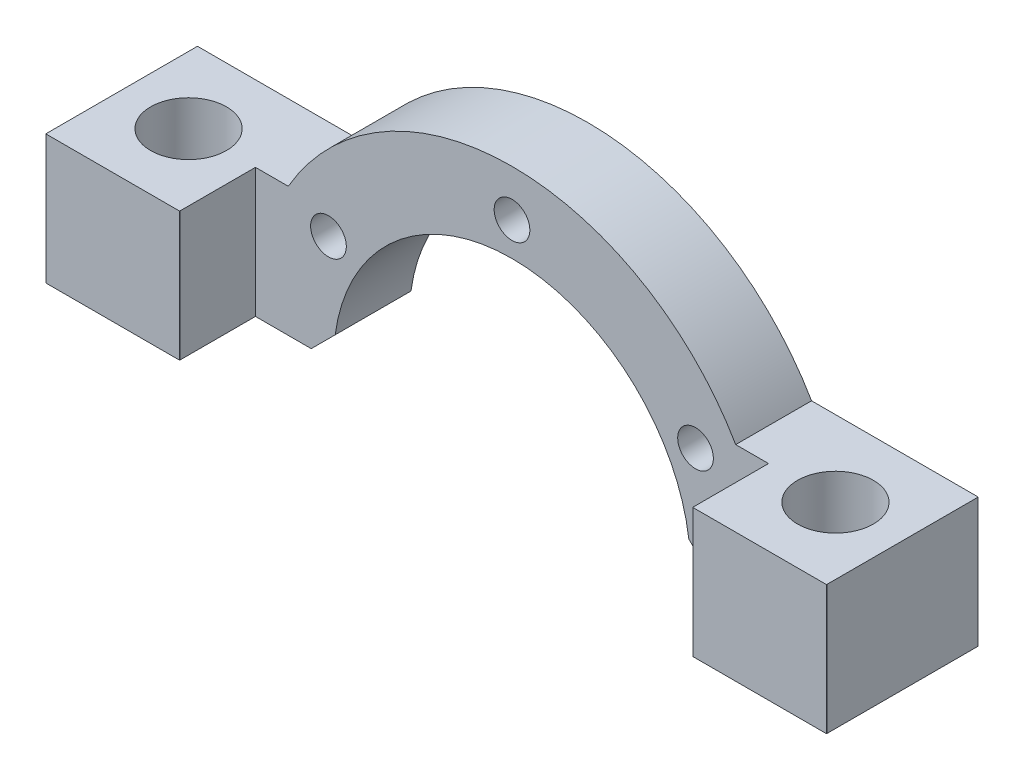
ISO-10303-21;
HEADER;
FILE_DESCRIPTION(('STEP AP214'),'2;1');
FILE_NAME('part.step','',(''),(''),'','','');
FILE_SCHEMA(('AUTOMOTIVE_DESIGN { 1 0 10303 214 1 1 1 1 }'));
ENDSEC;
DATA;
#1=APPLICATION_CONTEXT('core data for automotive mechanical design processes');
#2=APPLICATION_PROTOCOL_DEFINITION('international standard','automotive_design',2000,#1);
#3=PRODUCT_CONTEXT('',#1,'mechanical');
#4=PRODUCT('Part','Part','',(#3));
#5=PRODUCT_RELATED_PRODUCT_CATEGORY('part','',(#4));
#6=PRODUCT_DEFINITION_FORMATION('','',#4);
#7=PRODUCT_DEFINITION_CONTEXT('part definition',#1,'design');
#8=PRODUCT_DEFINITION('design','',#6,#7);
#9=PRODUCT_DEFINITION_SHAPE('','',#8);
#10=(LENGTH_UNIT() NAMED_UNIT(*) SI_UNIT(.MILLI.,.METRE.));
#11=(NAMED_UNIT(*) PLANE_ANGLE_UNIT() SI_UNIT($,.RADIAN.));
#12=(NAMED_UNIT(*) SI_UNIT($,.STERADIAN.) SOLID_ANGLE_UNIT());
#13=UNCERTAINTY_MEASURE_WITH_UNIT(LENGTH_MEASURE(1.E-05),#10,'distance_accuracy_value','');
#14=(GEOMETRIC_REPRESENTATION_CONTEXT(3) GLOBAL_UNCERTAINTY_ASSIGNED_CONTEXT((#13)) GLOBAL_UNIT_ASSIGNED_CONTEXT((#10,
#11,#12)) REPRESENTATION_CONTEXT('',''));
#15=CARTESIAN_POINT('',(0.,0.,0.));
#16=DIRECTION('',(0.,0.,1.));
#17=DIRECTION('',(1.,0.,0.));
#18=AXIS2_PLACEMENT_3D('',#15,#16,#17);
#19=CARTESIAN_POINT('',(0.,0.,3.4));
#20=DIRECTION('',(0.,0.,-1.));
#21=DIRECTION('',(-1.,0.,0.));
#22=AXIS2_PLACEMENT_3D('',#19,#20,#21);
#23=PLANE('',#22);
#24=CARTESIAN_POINT('',(8.22724133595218,4.74999999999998,3.4));
#25=DIRECTION('',(0.,0.,-1.));
#26=DIRECTION('',(-1.,0.,0.));
#27=AXIS2_PLACEMENT_3D('',#24,#25,#26);
#28=CIRCLE('',#27,0.799999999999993);
#29=CARTESIAN_POINT('',(7.42724133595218,4.74999999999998,3.4));
#30=VERTEX_POINT('',#29);
#31=EDGE_CURVE('E312',#30,#30,#28,.T.);
#32=ORIENTED_EDGE('',*,*,#31,.T.);
#33=EDGE_LOOP('',(#32));
#34=FACE_BOUND('',#33,.T.);
#35=CARTESIAN_POINT('',(0.,9.5,3.4));
#36=DIRECTION('',(0.,0.,-1.));
#37=DIRECTION('',(-1.,0.,0.));
#38=AXIS2_PLACEMENT_3D('',#35,#36,#37);
#39=CIRCLE('',#38,0.799999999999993);
#40=CARTESIAN_POINT('',(-0.799999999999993,9.5,3.4));
#41=VERTEX_POINT('',#40);
#42=EDGE_CURVE('E320',#41,#41,#39,.T.);
#43=ORIENTED_EDGE('',*,*,#42,.T.);
#44=EDGE_LOOP('',(#43));
#45=FACE_BOUND('',#44,.T.);
#46=CARTESIAN_POINT('',(-8.22724133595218,4.74999999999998,3.4));
#47=DIRECTION('',(0.,0.,-1.));
#48=DIRECTION('',(-1.,0.,0.));
#49=AXIS2_PLACEMENT_3D('',#46,#47,#48);
#50=CIRCLE('',#49,0.799999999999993);
#51=CARTESIAN_POINT('',(-9.02724133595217,4.74999999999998,3.4));
#52=VERTEX_POINT('',#51);
#53=EDGE_CURVE('E328',#52,#52,#50,.T.);
#54=ORIENTED_EDGE('',*,*,#53,.T.);
#55=EDGE_LOOP('',(#54));
#56=FACE_BOUND('',#55,.T.);
#57=CARTESIAN_POINT('',(0.,0.,3.4));
#58=DIRECTION('',(0.,0.,-1.));
#59=DIRECTION('',(-1.,0.,0.));
#60=AXIS2_PLACEMENT_3D('',#57,#58,#59);
#61=CIRCLE('',#60,8.);
#62=CARTESIAN_POINT('',(-7.92782730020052,1.07217269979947,3.4));
#63=VERTEX_POINT('',#62);
#64=CARTESIAN_POINT('',(7.92782730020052,1.07217269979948,3.4));
#65=VERTEX_POINT('',#64);
#66=EDGE_CURVE('E356',#63,#65,#61,.T.);
#67=ORIENTED_EDGE('',*,*,#66,.T.);
#68=DIRECTION('',(-0.707106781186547,0.707106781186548,0.));
#69=VECTOR('',#68,1.);
#70=CARTESIAN_POINT('',(9.,0.,3.4));
#71=LINE('',#70,#69);
#72=CARTESIAN_POINT('',(9.,0.,3.4));
#73=VERTEX_POINT('',#72);
#74=EDGE_CURVE('E98',#65,#73,#71,.F.);
#75=ORIENTED_EDGE('',*,*,#74,.T.);
#76=DIRECTION('',(1.,0.,0.));
#77=VECTOR('',#76,1.);
#78=CARTESIAN_POINT('',(17.5,0.,3.4));
#79=LINE('',#78,#77);
#80=CARTESIAN_POINT('',(11.5,0.,3.4));
#81=VERTEX_POINT('',#80);
#82=EDGE_CURVE('E359',#73,#81,#79,.T.);
#83=ORIENTED_EDGE('',*,*,#82,.T.);
#84=DIRECTION('',(0.,-1.,0.));
#85=VECTOR('',#84,1.);
#86=CARTESIAN_POINT('',(11.5,11.58,3.4));
#87=LINE('',#86,#85);
#88=CARTESIAN_POINT('',(11.5,5.79,3.4));
#89=VERTEX_POINT('',#88);
#90=EDGE_CURVE('E332',#89,#81,#87,.T.);
#91=ORIENTED_EDGE('',*,*,#90,.F.);
#92=DIRECTION('',(-1.,0.,0.));
#93=VECTOR('',#92,1.);
#94=CARTESIAN_POINT('',(0.,5.79,3.4));
#95=LINE('',#94,#93);
#96=CARTESIAN_POINT('',(10.0285741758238,5.79,3.4));
#97=VERTEX_POINT('',#96);
#98=EDGE_CURVE('E274',#89,#97,#95,.T.);
#99=ORIENTED_EDGE('',*,*,#98,.T.);
#100=CARTESIAN_POINT('',(0.,0.,3.4));
#101=DIRECTION('',(0.,0.,-1.));
#102=DIRECTION('',(-1.,0.,0.));
#103=AXIS2_PLACEMENT_3D('',#100,#101,#102);
#104=CIRCLE('',#103,11.58);
#105=CARTESIAN_POINT('',(-10.0285741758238,5.79,3.4));
#106=VERTEX_POINT('',#105);
#107=EDGE_CURVE('E250',#106,#97,#104,.T.);
#108=ORIENTED_EDGE('',*,*,#107,.F.);
#109=DIRECTION('',(-1.,0.,0.));
#110=VECTOR('',#109,1.);
#111=CARTESIAN_POINT('',(0.,5.79,3.4));
#112=LINE('',#111,#110);
#113=CARTESIAN_POINT('',(-11.5,5.79,3.4));
#114=VERTEX_POINT('',#113);
#115=EDGE_CURVE('E299',#106,#114,#112,.T.);
#116=ORIENTED_EDGE('',*,*,#115,.T.);
#117=DIRECTION('',(0.,1.,0.));
#118=VECTOR('',#117,1.);
#119=CARTESIAN_POINT('',(-11.5,11.58,3.4));
#120=LINE('',#119,#118);
#121=CARTESIAN_POINT('',(-11.5,0.,3.4));
#122=VERTEX_POINT('',#121);
#123=EDGE_CURVE('E344',#122,#114,#120,.T.);
#124=ORIENTED_EDGE('',*,*,#123,.F.);
#125=DIRECTION('',(1.,0.,0.));
#126=VECTOR('',#125,1.);
#127=CARTESIAN_POINT('',(-8.,0.,3.4));
#128=LINE('',#127,#126);
#129=CARTESIAN_POINT('',(-9.,0.,3.4));
#130=VERTEX_POINT('',#129);
#131=EDGE_CURVE('E363',#122,#130,#128,.T.);
#132=ORIENTED_EDGE('',*,*,#131,.T.);
#133=DIRECTION('',(-0.707106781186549,-0.707106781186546,0.));
#134=VECTOR('',#133,1.);
#135=CARTESIAN_POINT('',(-7.92782730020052,1.07217269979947,3.4));
#136=LINE('',#135,#134);
#137=EDGE_CURVE('E462',#130,#63,#136,.F.);
#138=ORIENTED_EDGE('',*,*,#137,.T.);
#139=EDGE_LOOP('',(#67,#75,#83,#91,#99,#108,#116,#124,#132,#138));
#140=FACE_BOUND('',#139,.T.);
#141=ADVANCED_FACE('F87',(#34,#45,#56,#140),#23,.F.);
#142=CARTESIAN_POINT('',(0.,0.,0.));
#143=DIRECTION('',(0.,0.,-1.));
#144=DIRECTION('',(-1.,0.,0.));
#145=AXIS2_PLACEMENT_3D('',#142,#143,#144);
#146=PLANE('',#145);
#147=CARTESIAN_POINT('',(8.22724133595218,4.74999999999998,0.));
#148=DIRECTION('',(0.,0.,-1.));
#149=DIRECTION('',(-1.,0.,0.));
#150=AXIS2_PLACEMENT_3D('',#147,#148,#149);
#151=CIRCLE('',#150,0.799999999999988);
#152=CARTESIAN_POINT('',(7.42724133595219,4.74999999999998,0.));
#153=VERTEX_POINT('',#152);
#154=EDGE_CURVE('E308',#153,#153,#151,.T.);
#155=ORIENTED_EDGE('',*,*,#154,.F.);
#156=EDGE_LOOP('',(#155));
#157=FACE_BOUND('',#156,.T.);
#158=CARTESIAN_POINT('',(0.,9.5,0.));
#159=DIRECTION('',(0.,0.,-1.));
#160=DIRECTION('',(-1.,0.,0.));
#161=AXIS2_PLACEMENT_3D('',#158,#159,#160);
#162=CIRCLE('',#161,0.799999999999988);
#163=CARTESIAN_POINT('',(-0.799999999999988,9.5,0.));
#164=VERTEX_POINT('',#163);
#165=EDGE_CURVE('E316',#164,#164,#162,.T.);
#166=ORIENTED_EDGE('',*,*,#165,.F.);
#167=EDGE_LOOP('',(#166));
#168=FACE_BOUND('',#167,.T.);
#169=CARTESIAN_POINT('',(-8.22724133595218,4.74999999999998,0.));
#170=DIRECTION('',(0.,0.,-1.));
#171=DIRECTION('',(-1.,0.,0.));
#172=AXIS2_PLACEMENT_3D('',#169,#170,#171);
#173=CIRCLE('',#172,0.799999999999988);
#174=CARTESIAN_POINT('',(-9.02724133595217,4.74999999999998,0.));
#175=VERTEX_POINT('',#174);
#176=EDGE_CURVE('E324',#175,#175,#173,.T.);
#177=ORIENTED_EDGE('',*,*,#176,.F.);
#178=EDGE_LOOP('',(#177));
#179=FACE_BOUND('',#178,.T.);
#180=DIRECTION('',(1.,0.,0.));
#181=VECTOR('',#180,1.);
#182=CARTESIAN_POINT('',(17.5,0.,0.));
#183=LINE('',#182,#181);
#184=CARTESIAN_POINT('',(9.,0.,0.));
#185=VERTEX_POINT('',#184);
#186=CARTESIAN_POINT('',(17.49,0.,0.));
#187=VERTEX_POINT('',#186);
#188=EDGE_CURVE('E369',#185,#187,#183,.T.);
#189=ORIENTED_EDGE('',*,*,#188,.F.);
#190=DIRECTION('',(0.707106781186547,-0.707106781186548,0.));
#191=VECTOR('',#190,1.);
#192=CARTESIAN_POINT('',(4.5,4.5,0.));
#193=LINE('',#192,#191);
#194=CARTESIAN_POINT('',(7.92782730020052,1.07217269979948,0.));
#195=VERTEX_POINT('',#194);
#196=EDGE_CURVE('E453',#185,#195,#193,.F.);
#197=ORIENTED_EDGE('',*,*,#196,.T.);
#198=CARTESIAN_POINT('',(0.,0.,0.));
#199=DIRECTION('',(0.,0.,-1.));
#200=DIRECTION('',(-1.,0.,0.));
#201=AXIS2_PLACEMENT_3D('',#198,#199,#200);
#202=CIRCLE('',#201,8.);
#203=CARTESIAN_POINT('',(-7.92782730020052,1.07217269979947,0.));
#204=VERTEX_POINT('',#203);
#205=EDGE_CURVE('E355',#204,#195,#202,.T.);
#206=ORIENTED_EDGE('',*,*,#205,.F.);
#207=DIRECTION('',(0.707106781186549,0.707106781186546,0.));
#208=VECTOR('',#207,1.);
#209=CARTESIAN_POINT('',(-4.49999999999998,4.5,0.));
#210=LINE('',#209,#208);
#211=CARTESIAN_POINT('',(-9.,0.,0.));
#212=VERTEX_POINT('',#211);
#213=EDGE_CURVE('E450',#204,#212,#210,.F.);
#214=ORIENTED_EDGE('',*,*,#213,.T.);
#215=DIRECTION('',(1.,0.,0.));
#216=VECTOR('',#215,1.);
#217=CARTESIAN_POINT('',(-8.,0.,0.));
#218=LINE('',#217,#216);
#219=CARTESIAN_POINT('',(-17.49,0.,0.));
#220=VERTEX_POINT('',#219);
#221=EDGE_CURVE('E360',#220,#212,#218,.T.);
#222=ORIENTED_EDGE('',*,*,#221,.F.);
#223=DIRECTION('',(0.,1.,0.));
#224=VECTOR('',#223,1.);
#225=CARTESIAN_POINT('',(-17.49,11.58,0.));
#226=LINE('',#225,#224);
#227=CARTESIAN_POINT('',(-17.49,5.79,0.));
#228=VERTEX_POINT('',#227);
#229=EDGE_CURVE('E388',#220,#228,#226,.T.);
#230=ORIENTED_EDGE('',*,*,#229,.T.);
#231=DIRECTION('',(1.,0.,0.));
#232=VECTOR('',#231,1.);
#233=CARTESIAN_POINT('',(0.,5.79,0.));
#234=LINE('',#233,#232);
#235=CARTESIAN_POINT('',(-10.0285741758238,5.79,0.));
#236=VERTEX_POINT('',#235);
#237=EDGE_CURVE('E239',#228,#236,#234,.T.);
#238=ORIENTED_EDGE('',*,*,#237,.T.);
#239=CARTESIAN_POINT('',(0.,0.,0.));
#240=DIRECTION('',(0.,0.,1.));
#241=DIRECTION('',(1.,0.,0.));
#242=AXIS2_PLACEMENT_3D('',#239,#240,#241);
#243=CIRCLE('',#242,11.58);
#244=CARTESIAN_POINT('',(10.0285741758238,5.79,0.));
#245=VERTEX_POINT('',#244);
#246=EDGE_CURVE('E230',#245,#236,#243,.T.);
#247=ORIENTED_EDGE('',*,*,#246,.F.);
#248=DIRECTION('',(1.,0.,0.));
#249=VECTOR('',#248,1.);
#250=CARTESIAN_POINT('',(0.,5.79,0.));
#251=LINE('',#250,#249);
#252=CARTESIAN_POINT('',(17.49,5.79,0.));
#253=VERTEX_POINT('',#252);
#254=EDGE_CURVE('E236',#245,#253,#251,.T.);
#255=ORIENTED_EDGE('',*,*,#254,.T.);
#256=DIRECTION('',(0.,-1.,0.));
#257=VECTOR('',#256,1.);
#258=CARTESIAN_POINT('',(17.49,0.,0.));
#259=LINE('',#258,#257);
#260=EDGE_CURVE('E391',#253,#187,#259,.T.);
#261=ORIENTED_EDGE('',*,*,#260,.T.);
#262=EDGE_LOOP('',(#189,#197,#206,#214,#222,#230,#238,#247,#255,#261));
#263=FACE_BOUND('',#262,.T.);
#264=ADVANCED_FACE('F233',(#157,#168,#179,#263),#146,.T.);
#265=CARTESIAN_POINT('',(0.,0.,3.4));
#266=DIRECTION('',(0.,0.,-1.));
#267=DIRECTION('',(-1.,0.,0.));
#268=AXIS2_PLACEMENT_3D('',#265,#266,#267);
#269=CYLINDRICAL_SURFACE('',#268,8.);
#270=ORIENTED_EDGE('',*,*,#205,.T.);
#271=DIRECTION('',(0.,0.,-1.));
#272=VECTOR('',#271,1.);
#273=CARTESIAN_POINT('',(7.92782730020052,1.07217269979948,3.4));
#274=LINE('',#273,#272);
#275=EDGE_CURVE('E112',#195,#65,#274,.F.);
#276=ORIENTED_EDGE('',*,*,#275,.T.);
#277=ORIENTED_EDGE('',*,*,#66,.F.);
#278=DIRECTION('',(0.,0.,-1.));
#279=VECTOR('',#278,1.);
#280=CARTESIAN_POINT('',(-7.92782730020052,1.07217269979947,3.4));
#281=LINE('',#280,#279);
#282=EDGE_CURVE('E456',#63,#204,#281,.T.);
#283=ORIENTED_EDGE('',*,*,#282,.T.);
#284=EDGE_LOOP('',(#270,#276,#277,#283));
#285=FACE_BOUND('',#284,.T.);
#286=ADVANCED_FACE('F510',(#285),#269,.F.);
#287=CARTESIAN_POINT('',(17.5,0.,3.4));
#288=DIRECTION('',(0.,1.,0.));
#289=DIRECTION('',(-1.,0.,0.));
#290=AXIS2_PLACEMENT_3D('',#287,#288,#289);
#291=PLANE('',#290);
#292=CARTESIAN_POINT('',(14.5,0.,3.4));
#293=DIRECTION('',(0.,1.,0.));
#294=DIRECTION('',(0.,0.,-1.));
#295=AXIS2_PLACEMENT_3D('',#292,#293,#294);
#296=CIRCLE('',#295,1.7);
#297=CARTESIAN_POINT('',(14.5,0.,1.7));
#298=VERTEX_POINT('',#297);
#299=EDGE_CURVE('E477',#298,#298,#296,.T.);
#300=ORIENTED_EDGE('',*,*,#299,.T.);
#301=EDGE_LOOP('',(#300));
#302=FACE_BOUND('',#301,.T.);
#303=ORIENTED_EDGE('',*,*,#82,.F.);
#304=DIRECTION('',(0.,0.,-1.));
#305=VECTOR('',#304,1.);
#306=CARTESIAN_POINT('',(9.,0.,3.4));
#307=LINE('',#306,#305);
#308=EDGE_CURVE('E446',#73,#185,#307,.T.);
#309=ORIENTED_EDGE('',*,*,#308,.T.);
#310=ORIENTED_EDGE('',*,*,#188,.T.);
#311=DIRECTION('',(0.707106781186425,0.,0.70710678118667));
#312=VECTOR('',#311,1.);
#313=CARTESIAN_POINT('',(17.5,0.,0.00999999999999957));
#314=LINE('',#313,#312);
#315=CARTESIAN_POINT('',(17.5,0.,0.00999999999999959));
#316=VERTEX_POINT('',#315);
#317=EDGE_CURVE('E400',#187,#316,#314,.T.);
#318=ORIENTED_EDGE('',*,*,#317,.T.);
#319=DIRECTION('',(0.,0.,-1.));
#320=VECTOR('',#319,1.);
#321=CARTESIAN_POINT('',(17.5,0.,3.4));
#322=LINE('',#321,#320);
#323=CARTESIAN_POINT('',(17.5,0.,6.79));
#324=VERTEX_POINT('',#323);
#325=EDGE_CURVE('E377',#324,#316,#322,.T.);
#326=ORIENTED_EDGE('',*,*,#325,.F.);
#327=DIRECTION('',(0.707106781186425,0.,-0.70710678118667));
#328=VECTOR('',#327,1.);
#329=CARTESIAN_POINT('',(17.49,0.,6.8));
#330=LINE('',#329,#328);
#331=CARTESIAN_POINT('',(17.49,0.,6.8));
#332=VERTEX_POINT('',#331);
#333=EDGE_CURVE('E397',#324,#332,#330,.F.);
#334=ORIENTED_EDGE('',*,*,#333,.T.);
#335=DIRECTION('',(1.,0.,0.));
#336=VECTOR('',#335,1.);
#337=CARTESIAN_POINT('',(17.5,0.,6.8));
#338=LINE('',#337,#336);
#339=CARTESIAN_POINT('',(11.51,0.,6.8));
#340=VERTEX_POINT('',#339);
#341=EDGE_CURVE('E333',#340,#332,#338,.T.);
#342=ORIENTED_EDGE('',*,*,#341,.F.);
#343=DIRECTION('',(0.707106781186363,0.,0.707106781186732));
#344=VECTOR('',#343,1.);
#345=CARTESIAN_POINT('',(11.51,0.,6.8));
#346=LINE('',#345,#344);
#347=CARTESIAN_POINT('',(11.5,0.,6.79));
#348=VERTEX_POINT('',#347);
#349=EDGE_CURVE('E394',#340,#348,#346,.F.);
#350=ORIENTED_EDGE('',*,*,#349,.T.);
#351=DIRECTION('',(0.,0.,-1.));
#352=VECTOR('',#351,1.);
#353=CARTESIAN_POINT('',(11.5,0.,6.8));
#354=LINE('',#353,#352);
#355=EDGE_CURVE('E337',#348,#81,#354,.T.);
#356=ORIENTED_EDGE('',*,*,#355,.T.);
#357=EDGE_LOOP('',(#303,#309,#310,#318,#326,#334,#342,#350,#356));
#358=FACE_BOUND('',#357,.T.);
#359=ADVANCED_FACE('F487',(#302,#358),#291,.F.);
#360=CARTESIAN_POINT('',(17.5,11.58,3.4));
#361=DIRECTION('',(-1.,0.,0.));
#362=DIRECTION('',(0.,0.,1.));
#363=AXIS2_PLACEMENT_3D('',#360,#361,#362);
#364=PLANE('',#363);
#365=DIRECTION('',(0.,1.,0.));
#366=VECTOR('',#365,1.);
#367=CARTESIAN_POINT('',(17.5,11.58,0.00999999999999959));
#368=LINE('',#367,#366);
#369=CARTESIAN_POINT('',(17.5,5.79,0.00999999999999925));
#370=VERTEX_POINT('',#369);
#371=EDGE_CURVE('E384',#316,#370,#368,.T.);
#372=ORIENTED_EDGE('',*,*,#371,.T.);
#373=DIRECTION('',(0.,0.,1.));
#374=VECTOR('',#373,1.);
#375=CARTESIAN_POINT('',(17.5,5.79,0.));
#376=LINE('',#375,#374);
#377=CARTESIAN_POINT('',(17.5,5.79,6.79));
#378=VERTEX_POINT('',#377);
#379=EDGE_CURVE('E254',#370,#378,#376,.T.);
#380=ORIENTED_EDGE('',*,*,#379,.T.);
#381=DIRECTION('',(0.,-1.,0.));
#382=VECTOR('',#381,1.);
#383=CARTESIAN_POINT('',(17.5,11.58,6.79));
#384=LINE('',#383,#382);
#385=EDGE_CURVE('E381',#378,#324,#384,.T.);
#386=ORIENTED_EDGE('',*,*,#385,.T.);
#387=ORIENTED_EDGE('',*,*,#325,.T.);
#388=EDGE_LOOP('',(#372,#380,#386,#387));
#389=FACE_BOUND('',#388,.T.);
#390=ADVANCED_FACE('F524',(#389),#364,.F.);
#391=CARTESIAN_POINT('',(-17.5,0.,3.4));
#392=DIRECTION('',(1.,0.,0.));
#393=DIRECTION('',(0.,0.,-1.));
#394=AXIS2_PLACEMENT_3D('',#391,#392,#393);
#395=PLANE('',#394);
#396=DIRECTION('',(0.,1.,0.));
#397=VECTOR('',#396,1.);
#398=CARTESIAN_POINT('',(-17.5,11.58,6.79));
#399=LINE('',#398,#397);
#400=CARTESIAN_POINT('',(-17.5,0.,6.79));
#401=VERTEX_POINT('',#400);
#402=CARTESIAN_POINT('',(-17.5,5.79,6.79));
#403=VERTEX_POINT('',#402);
#404=EDGE_CURVE('E414',#401,#403,#399,.T.);
#405=ORIENTED_EDGE('',*,*,#404,.T.);
#406=DIRECTION('',(0.,0.,1.));
#407=VECTOR('',#406,1.);
#408=CARTESIAN_POINT('',(-17.5,5.79,0.));
#409=LINE('',#408,#407);
#410=CARTESIAN_POINT('',(-17.5,5.79,0.00999999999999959));
#411=VERTEX_POINT('',#410);
#412=EDGE_CURVE('E286',#411,#403,#409,.T.);
#413=ORIENTED_EDGE('',*,*,#412,.F.);
#414=DIRECTION('',(0.,-1.,0.));
#415=VECTOR('',#414,1.);
#416=CARTESIAN_POINT('',(-17.5,0.,0.00999999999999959));
#417=LINE('',#416,#415);
#418=CARTESIAN_POINT('',(-17.5,0.,0.00999999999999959));
#419=VERTEX_POINT('',#418);
#420=EDGE_CURVE('E418',#411,#419,#417,.T.);
#421=ORIENTED_EDGE('',*,*,#420,.T.);
#422=DIRECTION('',(0.,0.,-1.));
#423=VECTOR('',#422,1.);
#424=CARTESIAN_POINT('',(-17.5,0.,3.4));
#425=LINE('',#424,#423);
#426=EDGE_CURVE('E366',#401,#419,#425,.T.);
#427=ORIENTED_EDGE('',*,*,#426,.F.);
#428=EDGE_LOOP('',(#405,#413,#421,#427));
#429=FACE_BOUND('',#428,.T.);
#430=ADVANCED_FACE('F521',(#429),#395,.F.);
#431=CARTESIAN_POINT('',(-8.,0.,3.4));
#432=DIRECTION('',(0.,1.,0.));
#433=DIRECTION('',(-1.,0.,0.));
#434=AXIS2_PLACEMENT_3D('',#431,#432,#433);
#435=PLANE('',#434);
#436=CARTESIAN_POINT('',(-14.5,0.,3.4));
#437=DIRECTION('',(0.,1.,0.));
#438=DIRECTION('',(0.,0.,1.));
#439=AXIS2_PLACEMENT_3D('',#436,#437,#438);
#440=CIRCLE('',#439,1.7);
#441=CARTESIAN_POINT('',(-14.5,0.,5.1));
#442=VERTEX_POINT('',#441);
#443=EDGE_CURVE('E469',#442,#442,#440,.T.);
#444=ORIENTED_EDGE('',*,*,#443,.T.);
#445=EDGE_LOOP('',(#444));
#446=FACE_BOUND('',#445,.T.);
#447=ORIENTED_EDGE('',*,*,#221,.T.);
#448=DIRECTION('',(0.,0.,1.));
#449=VECTOR('',#448,1.);
#450=CARTESIAN_POINT('',(-9.,0.,3.4));
#451=LINE('',#450,#449);
#452=EDGE_CURVE('E12',#212,#130,#451,.T.);
#453=ORIENTED_EDGE('',*,*,#452,.T.);
#454=ORIENTED_EDGE('',*,*,#131,.F.);
#455=DIRECTION('',(0.,0.,-1.));
#456=VECTOR('',#455,1.);
#457=CARTESIAN_POINT('',(-11.5,0.,6.8));
#458=LINE('',#457,#456);
#459=CARTESIAN_POINT('',(-11.5,0.,6.79));
#460=VERTEX_POINT('',#459);
#461=EDGE_CURVE('E349',#460,#122,#458,.T.);
#462=ORIENTED_EDGE('',*,*,#461,.F.);
#463=DIRECTION('',(-0.707106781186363,0.,0.707106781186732));
#464=VECTOR('',#463,1.);
#465=CARTESIAN_POINT('',(-11.51,0.,6.8));
#466=LINE('',#465,#464);
#467=CARTESIAN_POINT('',(-11.51,0.,6.8));
#468=VERTEX_POINT('',#467);
#469=EDGE_CURVE('E424',#460,#468,#466,.T.);
#470=ORIENTED_EDGE('',*,*,#469,.T.);
#471=DIRECTION('',(1.,0.,0.));
#472=VECTOR('',#471,1.);
#473=CARTESIAN_POINT('',(-17.5,0.,6.8));
#474=LINE('',#473,#472);
#475=CARTESIAN_POINT('',(-17.49,0.,6.8));
#476=VERTEX_POINT('',#475);
#477=EDGE_CURVE('E345',#476,#468,#474,.T.);
#478=ORIENTED_EDGE('',*,*,#477,.F.);
#479=DIRECTION('',(-0.707106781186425,0.,-0.70710678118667));
#480=VECTOR('',#479,1.);
#481=CARTESIAN_POINT('',(-17.49,0.,6.8));
#482=LINE('',#481,#480);
#483=EDGE_CURVE('E421',#476,#401,#482,.T.);
#484=ORIENTED_EDGE('',*,*,#483,.T.);
#485=ORIENTED_EDGE('',*,*,#426,.T.);
#486=DIRECTION('',(0.707106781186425,0.,-0.70710678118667));
#487=VECTOR('',#486,1.);
#488=CARTESIAN_POINT('',(-17.5,0.,0.00999999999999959));
#489=LINE('',#488,#487);
#490=EDGE_CURVE('E427',#419,#220,#489,.T.);
#491=ORIENTED_EDGE('',*,*,#490,.T.);
#492=EDGE_LOOP('',(#447,#453,#454,#462,#470,#478,#484,#485,#491));
#493=FACE_BOUND('',#492,.T.);
#494=ADVANCED_FACE('F518',(#446,#493),#435,.F.);
#495=CARTESIAN_POINT('',(-11.5,11.58,6.8));
#496=DIRECTION('',(-1.,0.,0.));
#497=DIRECTION('',(0.,-1.,0.));
#498=AXIS2_PLACEMENT_3D('',#495,#496,#497);
#499=PLANE('',#498);
#500=ORIENTED_EDGE('',*,*,#123,.T.);
#501=DIRECTION('',(0.,0.,1.));
#502=VECTOR('',#501,1.);
#503=CARTESIAN_POINT('',(-11.5,5.79,6.8));
#504=LINE('',#503,#502);
#505=CARTESIAN_POINT('',(-11.5,5.79,6.79));
#506=VERTEX_POINT('',#505);
#507=EDGE_CURVE('E295',#114,#506,#504,.T.);
#508=ORIENTED_EDGE('',*,*,#507,.T.);
#509=DIRECTION('',(0.,-1.,0.));
#510=VECTOR('',#509,1.);
#511=CARTESIAN_POINT('',(-11.5,0.,6.79));
#512=LINE('',#511,#510);
#513=EDGE_CURVE('E437',#506,#460,#512,.T.);
#514=ORIENTED_EDGE('',*,*,#513,.T.);
#515=ORIENTED_EDGE('',*,*,#461,.T.);
#516=EDGE_LOOP('',(#500,#508,#514,#515));
#517=FACE_BOUND('',#516,.T.);
#518=ADVANCED_FACE('F515',(#517),#499,.F.);
#519=CARTESIAN_POINT('',(0.,0.,6.8));
#520=DIRECTION('',(0.,0.,1.));
#521=DIRECTION('',(1.,0.,0.));
#522=AXIS2_PLACEMENT_3D('',#519,#520,#521);
#523=PLANE('',#522);
#524=DIRECTION('',(1.,0.,0.));
#525=VECTOR('',#524,1.);
#526=CARTESIAN_POINT('',(0.,5.79,6.8));
#527=LINE('',#526,#525);
#528=CARTESIAN_POINT('',(-17.49,5.79,6.8));
#529=VERTEX_POINT('',#528);
#530=CARTESIAN_POINT('',(-11.51,5.79,6.8));
#531=VERTEX_POINT('',#530);
#532=EDGE_CURVE('E244',#529,#531,#527,.T.);
#533=ORIENTED_EDGE('',*,*,#532,.F.);
#534=DIRECTION('',(0.,-1.,0.));
#535=VECTOR('',#534,1.);
#536=CARTESIAN_POINT('',(-17.49,0.,6.8));
#537=LINE('',#536,#535);
#538=EDGE_CURVE('E430',#529,#476,#537,.T.);
#539=ORIENTED_EDGE('',*,*,#538,.T.);
#540=ORIENTED_EDGE('',*,*,#477,.T.);
#541=DIRECTION('',(0.,1.,0.));
#542=VECTOR('',#541,1.);
#543=CARTESIAN_POINT('',(-11.51,11.58,6.8));
#544=LINE('',#543,#542);
#545=EDGE_CURVE('E433',#468,#531,#544,.T.);
#546=ORIENTED_EDGE('',*,*,#545,.T.);
#547=EDGE_LOOP('',(#533,#539,#540,#546));
#548=FACE_BOUND('',#547,.T.);
#549=ADVANCED_FACE('F626',(#548),#523,.T.);
#550=CARTESIAN_POINT('',(11.5,11.58,6.8));
#551=DIRECTION('',(1.,0.,0.));
#552=DIRECTION('',(0.,1.,0.));
#553=AXIS2_PLACEMENT_3D('',#550,#551,#552);
#554=PLANE('',#553);
#555=DIRECTION('',(0.,1.,0.));
#556=VECTOR('',#555,1.);
#557=CARTESIAN_POINT('',(11.5,11.58,6.79));
#558=LINE('',#557,#556);
#559=CARTESIAN_POINT('',(11.5,5.79,6.79));
#560=VERTEX_POINT('',#559);
#561=EDGE_CURVE('E410',#348,#560,#558,.T.);
#562=ORIENTED_EDGE('',*,*,#561,.T.);
#563=DIRECTION('',(0.,0.,-1.));
#564=VECTOR('',#563,1.);
#565=CARTESIAN_POINT('',(11.5,5.79,6.8));
#566=LINE('',#565,#564);
#567=EDGE_CURVE('E269',#560,#89,#566,.T.);
#568=ORIENTED_EDGE('',*,*,#567,.T.);
#569=ORIENTED_EDGE('',*,*,#90,.T.);
#570=ORIENTED_EDGE('',*,*,#355,.F.);
#571=EDGE_LOOP('',(#562,#568,#569,#570));
#572=FACE_BOUND('',#571,.T.);
#573=ADVANCED_FACE('F595',(#572),#554,.F.);
#574=CARTESIAN_POINT('',(0.,0.,6.8));
#575=DIRECTION('',(0.,0.,-1.));
#576=DIRECTION('',(-1.,0.,0.));
#577=AXIS2_PLACEMENT_3D('',#574,#575,#576);
#578=PLANE('',#577);
#579=DIRECTION('',(0.,1.,0.));
#580=VECTOR('',#579,1.);
#581=CARTESIAN_POINT('',(17.49,0.,6.8));
#582=LINE('',#581,#580);
#583=CARTESIAN_POINT('',(17.49,5.79,6.8));
#584=VERTEX_POINT('',#583);
#585=EDGE_CURVE('E406',#332,#584,#582,.T.);
#586=ORIENTED_EDGE('',*,*,#585,.T.);
#587=DIRECTION('',(1.,0.,0.));
#588=VECTOR('',#587,1.);
#589=CARTESIAN_POINT('',(0.,5.79,6.8));
#590=LINE('',#589,#588);
#591=CARTESIAN_POINT('',(11.51,5.79,6.8));
#592=VERTEX_POINT('',#591);
#593=EDGE_CURVE('E260',#592,#584,#590,.T.);
#594=ORIENTED_EDGE('',*,*,#593,.F.);
#595=DIRECTION('',(0.,-1.,0.));
#596=VECTOR('',#595,1.);
#597=CARTESIAN_POINT('',(11.51,0.,6.8));
#598=LINE('',#597,#596);
#599=EDGE_CURVE('E403',#592,#340,#598,.T.);
#600=ORIENTED_EDGE('',*,*,#599,.T.);
#601=ORIENTED_EDGE('',*,*,#341,.T.);
#602=EDGE_LOOP('',(#586,#594,#600,#601));
#603=FACE_BOUND('',#602,.T.);
#604=ADVANCED_FACE('F541',(#603),#578,.F.);
#605=CARTESIAN_POINT('',(17.5,11.58,0.00999999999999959));
#606=DIRECTION('',(0.70710678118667,0.,-0.707106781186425));
#607=DIRECTION('',(0.,-1.,0.));
#608=AXIS2_PLACEMENT_3D('',#605,#606,#607);
#609=PLANE('',#608);
#610=DIRECTION('',(-0.707106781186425,0.,-0.70710678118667));
#611=VECTOR('',#610,1.);
#612=CARTESIAN_POINT('',(17.5,5.79,0.00999999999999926));
#613=LINE('',#612,#611);
#614=EDGE_CURVE('E258',#370,#253,#613,.T.);
#615=ORIENTED_EDGE('',*,*,#614,.F.);
#616=ORIENTED_EDGE('',*,*,#371,.F.);
#617=ORIENTED_EDGE('',*,*,#317,.F.);
#618=ORIENTED_EDGE('',*,*,#260,.F.);
#619=EDGE_LOOP('',(#615,#616,#617,#618));
#620=FACE_BOUND('',#619,.T.);
#621=ADVANCED_FACE('F534',(#620),#609,.T.);
#622=CARTESIAN_POINT('',(17.49,0.,6.8));
#623=DIRECTION('',(-0.70710678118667,0.,-0.707106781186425));
#624=DIRECTION('',(0.,1.,0.));
#625=AXIS2_PLACEMENT_3D('',#622,#623,#624);
#626=PLANE('',#625);
#627=DIRECTION('',(-0.707106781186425,0.,0.70710678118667));
#628=VECTOR('',#627,1.);
#629=CARTESIAN_POINT('',(17.49,5.79,6.8));
#630=LINE('',#629,#628);
#631=EDGE_CURVE('E277',#584,#378,#630,.F.);
#632=ORIENTED_EDGE('',*,*,#631,.F.);
#633=ORIENTED_EDGE('',*,*,#585,.F.);
#634=ORIENTED_EDGE('',*,*,#333,.F.);
#635=ORIENTED_EDGE('',*,*,#385,.F.);
#636=EDGE_LOOP('',(#632,#633,#634,#635));
#637=FACE_BOUND('',#636,.T.);
#638=ADVANCED_FACE('F540',(#637),#626,.F.);
#639=CARTESIAN_POINT('',(11.51,0.,6.8));
#640=DIRECTION('',(0.707106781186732,0.,-0.707106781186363));
#641=DIRECTION('',(0.,-1.,0.));
#642=AXIS2_PLACEMENT_3D('',#639,#640,#641);
#643=PLANE('',#642);
#644=DIRECTION('',(-0.707106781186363,0.,-0.707106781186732));
#645=VECTOR('',#644,1.);
#646=CARTESIAN_POINT('',(11.51,5.79,6.8));
#647=LINE('',#646,#645);
#648=EDGE_CURVE('E443',#560,#592,#647,.F.);
#649=ORIENTED_EDGE('',*,*,#648,.F.);
#650=ORIENTED_EDGE('',*,*,#561,.F.);
#651=ORIENTED_EDGE('',*,*,#349,.F.);
#652=ORIENTED_EDGE('',*,*,#599,.F.);
#653=EDGE_LOOP('',(#649,#650,#651,#652));
#654=FACE_BOUND('',#653,.T.);
#655=ADVANCED_FACE('F548',(#654),#643,.F.);
#656=CARTESIAN_POINT('',(-17.5,0.,0.00999999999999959));
#657=DIRECTION('',(-0.70710678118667,0.,-0.707106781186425));
#658=DIRECTION('',(0.,1.,0.));
#659=AXIS2_PLACEMENT_3D('',#656,#657,#658);
#660=PLANE('',#659);
#661=DIRECTION('',(-0.707106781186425,0.,0.70710678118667));
#662=VECTOR('',#661,1.);
#663=CARTESIAN_POINT('',(-17.5,5.79,0.00999999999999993));
#664=LINE('',#663,#662);
#665=EDGE_CURVE('E303',#228,#411,#664,.T.);
#666=ORIENTED_EDGE('',*,*,#665,.F.);
#667=ORIENTED_EDGE('',*,*,#229,.F.);
#668=ORIENTED_EDGE('',*,*,#490,.F.);
#669=ORIENTED_EDGE('',*,*,#420,.F.);
#670=EDGE_LOOP('',(#666,#667,#668,#669));
#671=FACE_BOUND('',#670,.T.);
#672=ADVANCED_FACE('F555',(#671),#660,.T.);
#673=CARTESIAN_POINT('',(-11.51,0.,6.8));
#674=DIRECTION('',(0.707106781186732,0.,0.707106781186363));
#675=DIRECTION('',(0.,-1.,0.));
#676=AXIS2_PLACEMENT_3D('',#673,#674,#675);
#677=PLANE('',#676);
#678=DIRECTION('',(0.707106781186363,0.,-0.707106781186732));
#679=VECTOR('',#678,1.);
#680=CARTESIAN_POINT('',(-11.51,5.79,6.8));
#681=LINE('',#680,#679);
#682=EDGE_CURVE('E290',#531,#506,#681,.T.);
#683=ORIENTED_EDGE('',*,*,#682,.F.);
#684=ORIENTED_EDGE('',*,*,#545,.F.);
#685=ORIENTED_EDGE('',*,*,#469,.F.);
#686=ORIENTED_EDGE('',*,*,#513,.F.);
#687=EDGE_LOOP('',(#683,#684,#685,#686));
#688=FACE_BOUND('',#687,.T.);
#689=ADVANCED_FACE('F562',(#688),#677,.T.);
#690=CARTESIAN_POINT('',(-17.49,0.,6.8));
#691=DIRECTION('',(-0.70710678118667,0.,0.707106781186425));
#692=DIRECTION('',(0.,1.,0.));
#693=AXIS2_PLACEMENT_3D('',#690,#691,#692);
#694=PLANE('',#693);
#695=DIRECTION('',(0.707106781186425,0.,0.70710678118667));
#696=VECTOR('',#695,1.);
#697=CARTESIAN_POINT('',(-17.49,5.79,6.8));
#698=LINE('',#697,#696);
#699=EDGE_CURVE('E440',#403,#529,#698,.T.);
#700=ORIENTED_EDGE('',*,*,#699,.F.);
#701=ORIENTED_EDGE('',*,*,#404,.F.);
#702=ORIENTED_EDGE('',*,*,#483,.F.);
#703=ORIENTED_EDGE('',*,*,#538,.F.);
#704=EDGE_LOOP('',(#700,#701,#702,#703));
#705=FACE_BOUND('',#704,.T.);
#706=ADVANCED_FACE('F569',(#705),#694,.T.);
#707=CARTESIAN_POINT('',(-8.22724133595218,4.74999999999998,0.));
#708=DIRECTION('',(0.,0.,-1.));
#709=DIRECTION('',(-1.,0.,0.));
#710=AXIS2_PLACEMENT_3D('',#707,#708,#709);
#711=CYLINDRICAL_SURFACE('',#710,0.799999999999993);
#712=ORIENTED_EDGE('',*,*,#176,.T.);
#713=EDGE_LOOP('',(#712));
#714=FACE_BOUND('',#713,.T.);
#715=ORIENTED_EDGE('',*,*,#53,.F.);
#716=EDGE_LOOP('',(#715));
#717=FACE_BOUND('',#716,.T.);
#718=ADVANCED_FACE('F575',(#714,#717),#711,.F.);
#719=CARTESIAN_POINT('',(0.,9.5,0.));
#720=DIRECTION('',(0.,0.,-1.));
#721=DIRECTION('',(-1.,0.,0.));
#722=AXIS2_PLACEMENT_3D('',#719,#720,#721);
#723=CYLINDRICAL_SURFACE('',#722,0.799999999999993);
#724=ORIENTED_EDGE('',*,*,#165,.T.);
#725=EDGE_LOOP('',(#724));
#726=FACE_BOUND('',#725,.T.);
#727=ORIENTED_EDGE('',*,*,#42,.F.);
#728=EDGE_LOOP('',(#727));
#729=FACE_BOUND('',#728,.T.);
#730=ADVANCED_FACE('F646',(#726,#729),#723,.F.);
#731=CARTESIAN_POINT('',(8.22724133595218,4.74999999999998,0.));
#732=DIRECTION('',(0.,0.,-1.));
#733=DIRECTION('',(-1.,0.,0.));
#734=AXIS2_PLACEMENT_3D('',#731,#732,#733);
#735=CYLINDRICAL_SURFACE('',#734,0.799999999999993);
#736=ORIENTED_EDGE('',*,*,#154,.T.);
#737=EDGE_LOOP('',(#736));
#738=FACE_BOUND('',#737,.T.);
#739=ORIENTED_EDGE('',*,*,#31,.F.);
#740=EDGE_LOOP('',(#739));
#741=FACE_BOUND('',#740,.T.);
#742=ADVANCED_FACE('F650',(#738,#741),#735,.F.);
#743=CARTESIAN_POINT('',(0.,0.,0.));
#744=DIRECTION('',(0.,0.,1.));
#745=DIRECTION('',(1.,0.,0.));
#746=AXIS2_PLACEMENT_3D('',#743,#744,#745);
#747=CYLINDRICAL_SURFACE('',#746,11.58);
#748=ORIENTED_EDGE('',*,*,#107,.T.);
#749=DIRECTION('',(0.,0.,1.));
#750=VECTOR('',#749,1.);
#751=CARTESIAN_POINT('',(10.0285741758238,5.79,0.));
#752=LINE('',#751,#750);
#753=EDGE_CURVE('E247',#245,#97,#752,.T.);
#754=ORIENTED_EDGE('',*,*,#753,.F.);
#755=ORIENTED_EDGE('',*,*,#246,.T.);
#756=DIRECTION('',(0.,0.,1.));
#757=VECTOR('',#756,1.);
#758=CARTESIAN_POINT('',(-10.0285741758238,5.79,0.));
#759=LINE('',#758,#757);
#760=EDGE_CURVE('E287',#236,#106,#759,.T.);
#761=ORIENTED_EDGE('',*,*,#760,.T.);
#762=EDGE_LOOP('',(#748,#754,#755,#761));
#763=FACE_BOUND('',#762,.T.);
#764=ADVANCED_FACE('F248',(#763),#747,.T.);
#765=CARTESIAN_POINT('',(0.,5.79,0.));
#766=DIRECTION('',(0.,-1.,0.));
#767=DIRECTION('',(1.,0.,0.));
#768=AXIS2_PLACEMENT_3D('',#765,#766,#767);
#769=PLANE('',#768);
#770=CARTESIAN_POINT('',(-14.5,5.79,3.4));
#771=DIRECTION('',(0.,-1.,0.));
#772=DIRECTION('',(1.,0.,0.));
#773=AXIS2_PLACEMENT_3D('',#770,#771,#772);
#774=CIRCLE('',#773,1.7);
#775=CARTESIAN_POINT('',(-12.8,5.79,3.4));
#776=VERTEX_POINT('',#775);
#777=EDGE_CURVE('E92',#776,#776,#774,.T.);
#778=ORIENTED_EDGE('',*,*,#777,.T.);
#779=EDGE_LOOP('',(#778));
#780=FACE_BOUND('',#779,.T.);
#781=ORIENTED_EDGE('',*,*,#665,.T.);
#782=ORIENTED_EDGE('',*,*,#412,.T.);
#783=ORIENTED_EDGE('',*,*,#699,.T.);
#784=ORIENTED_EDGE('',*,*,#532,.T.);
#785=ORIENTED_EDGE('',*,*,#682,.T.);
#786=ORIENTED_EDGE('',*,*,#507,.F.);
#787=ORIENTED_EDGE('',*,*,#115,.F.);
#788=ORIENTED_EDGE('',*,*,#760,.F.);
#789=ORIENTED_EDGE('',*,*,#237,.F.);
#790=EDGE_LOOP('',(#781,#782,#783,#784,#785,#786,#787,#788,#789));
#791=FACE_BOUND('',#790,.T.);
#792=ADVANCED_FACE('F584',(#780,#791),#769,.F.);
#793=CARTESIAN_POINT('',(0.,5.79,0.));
#794=DIRECTION('',(0.,-1.,0.));
#795=DIRECTION('',(1.,0.,0.));
#796=AXIS2_PLACEMENT_3D('',#793,#794,#795);
#797=PLANE('',#796);
#798=CARTESIAN_POINT('',(14.5,5.79,3.4));
#799=DIRECTION('',(0.,-1.,0.));
#800=DIRECTION('',(1.,0.,0.));
#801=AXIS2_PLACEMENT_3D('',#798,#799,#800);
#802=CIRCLE('',#801,1.7);
#803=CARTESIAN_POINT('',(16.2,5.79,3.4));
#804=VERTEX_POINT('',#803);
#805=EDGE_CURVE('E466',#804,#804,#802,.T.);
#806=ORIENTED_EDGE('',*,*,#805,.T.);
#807=EDGE_LOOP('',(#806));
#808=FACE_BOUND('',#807,.T.);
#809=ORIENTED_EDGE('',*,*,#614,.T.);
#810=ORIENTED_EDGE('',*,*,#254,.F.);
#811=ORIENTED_EDGE('',*,*,#753,.T.);
#812=ORIENTED_EDGE('',*,*,#98,.F.);
#813=ORIENTED_EDGE('',*,*,#567,.F.);
#814=ORIENTED_EDGE('',*,*,#648,.T.);
#815=ORIENTED_EDGE('',*,*,#593,.T.);
#816=ORIENTED_EDGE('',*,*,#631,.T.);
#817=ORIENTED_EDGE('',*,*,#379,.F.);
#818=EDGE_LOOP('',(#809,#810,#811,#812,#813,#814,#815,#816,#817));
#819=FACE_BOUND('',#818,.T.);
#820=ADVANCED_FACE('F256',(#808,#819),#797,.F.);
#821=CARTESIAN_POINT('',(9.,0.,3.4));
#822=DIRECTION('',(0.707106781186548,0.707106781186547,0.));
#823=DIRECTION('',(0.,0.,-1.));
#824=AXIS2_PLACEMENT_3D('',#821,#822,#823);
#825=PLANE('',#824);
#826=ORIENTED_EDGE('',*,*,#74,.F.);
#827=ORIENTED_EDGE('',*,*,#275,.F.);
#828=ORIENTED_EDGE('',*,*,#196,.F.);
#829=ORIENTED_EDGE('',*,*,#308,.F.);
#830=EDGE_LOOP('',(#826,#827,#828,#829));
#831=FACE_BOUND('',#830,.T.);
#832=ADVANCED_FACE('F501',(#831),#825,.F.);
#833=CARTESIAN_POINT('',(-7.92782730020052,1.07217269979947,3.4));
#834=DIRECTION('',(-0.707106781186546,0.707106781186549,0.));
#835=DIRECTION('',(0.,0.,-1.));
#836=AXIS2_PLACEMENT_3D('',#833,#834,#835);
#837=PLANE('',#836);
#838=ORIENTED_EDGE('',*,*,#137,.F.);
#839=ORIENTED_EDGE('',*,*,#452,.F.);
#840=ORIENTED_EDGE('',*,*,#213,.F.);
#841=ORIENTED_EDGE('',*,*,#282,.F.);
#842=EDGE_LOOP('',(#838,#839,#840,#841));
#843=FACE_BOUND('',#842,.T.);
#844=ADVANCED_FACE('F90',(#843),#837,.F.);
#845=CARTESIAN_POINT('',(14.5,0.,3.4));
#846=DIRECTION('',(0.,1.,0.));
#847=DIRECTION('',(0.,0.,1.));
#848=AXIS2_PLACEMENT_3D('',#845,#846,#847);
#849=CYLINDRICAL_SURFACE('',#848,1.7);
#850=ORIENTED_EDGE('',*,*,#299,.F.);
#851=EDGE_LOOP('',(#850));
#852=FACE_BOUND('',#851,.T.);
#853=ORIENTED_EDGE('',*,*,#805,.F.);
#854=EDGE_LOOP('',(#853));
#855=FACE_BOUND('',#854,.T.);
#856=ADVANCED_FACE('F490',(#852,#855),#849,.F.);
#857=CARTESIAN_POINT('',(-14.5,0.,3.4));
#858=DIRECTION('',(0.,1.,0.));
#859=DIRECTION('',(0.,0.,1.));
#860=AXIS2_PLACEMENT_3D('',#857,#858,#859);
#861=CYLINDRICAL_SURFACE('',#860,1.7);
#862=ORIENTED_EDGE('',*,*,#443,.F.);
#863=EDGE_LOOP('',(#862));
#864=FACE_BOUND('',#863,.T.);
#865=ORIENTED_EDGE('',*,*,#777,.F.);
#866=EDGE_LOOP('',(#865));
#867=FACE_BOUND('',#866,.T.);
#868=ADVANCED_FACE('F493',(#864,#867),#861,.F.);
#869=CLOSED_SHELL('',(#141,#264,#286,#359,#390,#430,#494,#518,#549,#573,#604,#621,#638,#655,
#672,#689,#706,#718,#730,#742,#764,#792,#820,#832,#844,#856,#868));
#870=MANIFOLD_SOLID_BREP('B2',#869);
#871=ADVANCED_BREP_SHAPE_REPRESENTATION('',(#18,#870),#14);
#872=SHAPE_DEFINITION_REPRESENTATION(#9,#871);
ENDSEC;
END-ISO-10303-21;
